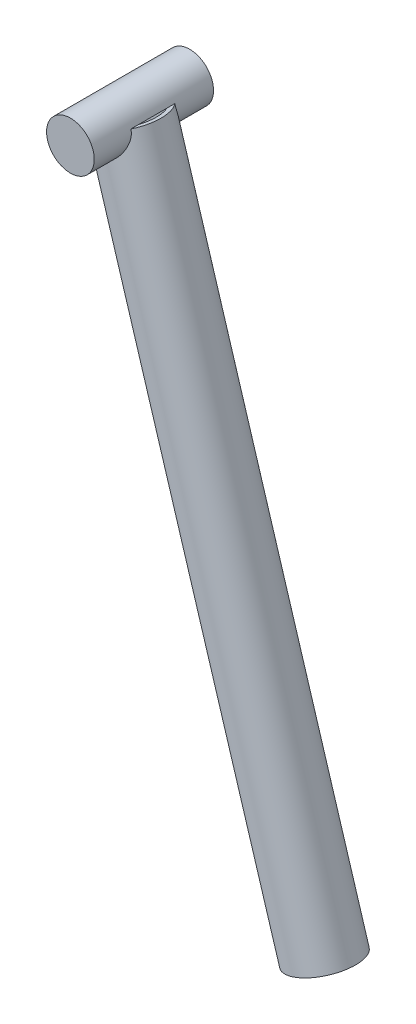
from build123d import *

# Parameters (mm, degrees)
TUBO_TIJA_PROFILE_R         = 13.6
CABEZA_PROFILE_R            = 10
VACIADO_TUBO_TIJA_PROFILE_R = 11.6


with BuildPart() as part:
    # Tubo_tija: sweep along a curve in space
    with BuildLine() as tubo_tija_path:
        Line((-115.633009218, 378.218530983, 0), (-197.165716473, 644.9, 0))
    # Tubo_tija profile (on start of the path) → Tubo_tija (sweep)
    with BuildSketch(Plane(origin=(-115.633009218, 378.218530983, 0), x_dir=(0.9563047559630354, 0.2923717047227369, 0), z_dir=(-0.2923717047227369, 0.9563047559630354, 0))):
        Circle(TUBO_TIJA_PROFILE_R)
    sweep(path=tubo_tija_path.line)

    # Cabeza: sweep along a curve in space
    with BuildLine() as cabeza_path:
        Line((-197.165716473, 644.9, -25), (-197.165716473, 644.9, 25))
    # Cabeza profile (on start of the path) → Cabeza (sweep)
    with BuildSketch(Plane(origin=(-197.165716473, 644.9, -25), x_dir=(1, 0, 0), z_dir=(0, 0, 1))):
        Circle(CABEZA_PROFILE_R)
    sweep(path=cabeza_path.line)

    # Vaciado_Tubo_tija: sweep along a curve in space
    with BuildLine() as vaciado_tubo_tija_path:
        Line((-115.633009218, 378.218530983, 0), (-197.165716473, 644.9, 0))
    # Vaciado_Tubo_tija profile (on start of the path) → Vaciado_Tubo_tija (sweep, cut)
    with BuildSketch(Plane(origin=(-115.633009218, 378.218530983, 0), x_dir=(0.9563047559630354, 0.2923717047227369, 0), z_dir=(-0.2923717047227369, 0.9563047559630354, 0))):
        Circle(VACIADO_TUBO_TIJA_PROFILE_R)
    sweep(path=vaciado_tubo_tija_path.line, mode=Mode.SUBTRACT)


solid = part.part
